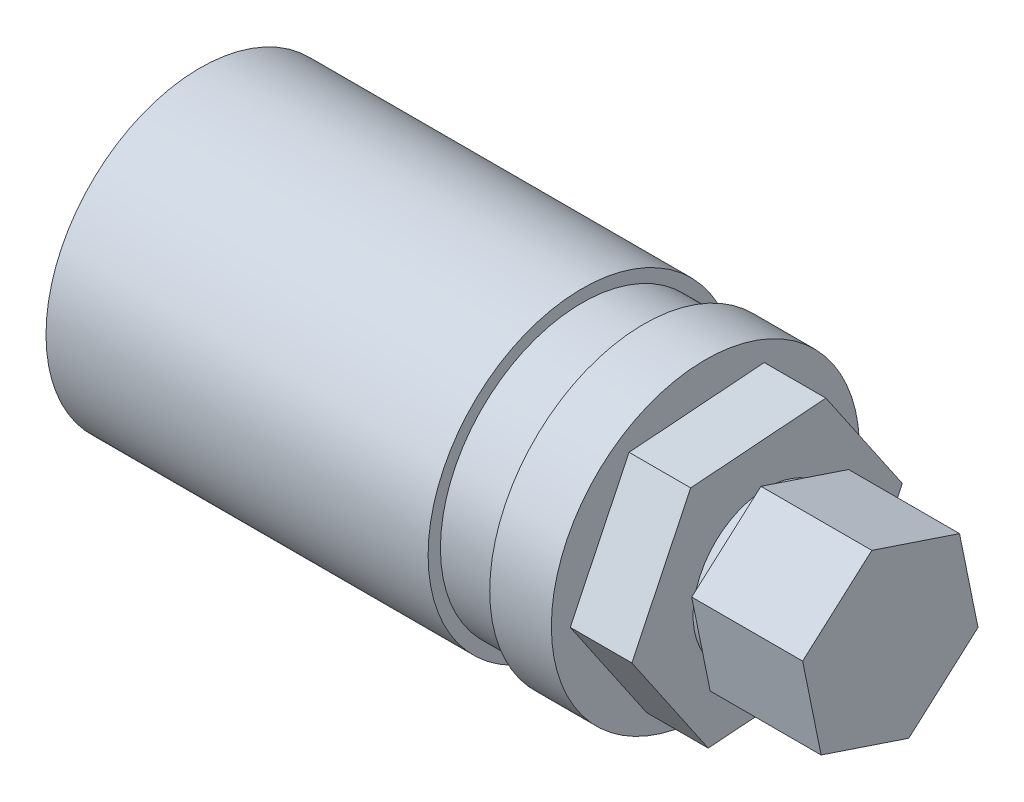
from build123d import *

# Parameters (mm, degrees)
SALIENTE_EXTRUIR1_DEPTH = 5
CROQUIS3_R              = 6
SALIENTE_EXTRUIR2_DEPTH = 1
SALIENTE_EXTRUIR3_DEPTH = 9


with BuildPart() as part:
    # Croquis1 → Revoluci_n1 (revolve)
    with BuildSketch(Plane.XY, mode=Mode.PRIVATE) as revoluci_n1_sk:
        Polygon((0, 0), (0, 12.5), (31, 12.5), (31, 11.5), (36, 11.5), (36, 12.5), (41, 12.5), (41, 0), align=None)
    revolve(revoluci_n1_sk.sketch.rotate(Axis((0, 0, 0), (1, 0, 0)), 90), axis=Axis((0, 0, 0), (1, 0, 0)))

    # Croquis2 → Saliente-Extruir1 (add)
    with BuildSketch(Plane(origin=(41, 0, 0), x_dir=(0, 0, -1), z_dir=(1, 0, 0))):
        Polygon((-6.197083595, 9.088242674), (-10.96919083, -0.822710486), (-4.772107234, -9.91095316), (6.197083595, -9.088242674), (10.96919083, 0.822710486), (4.772107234, 9.91095316), align=None)
    extrude(amount=SALIENTE_EXTRUIR1_DEPTH)

    # Croquis3 → Saliente-Extruir2 (add)
    with BuildSketch(Plane(origin=(46, 0, 0), x_dir=(0, 0, -1), z_dir=(1, 0, 0))):
        Circle(CROQUIS3_R)
    extrude(amount=SALIENTE_EXTRUIR2_DEPTH)

    # Croquis4 → Saliente-Extruir3 (add)
    with BuildSketch(Plane(origin=(47, 0, 0), x_dir=(0, 0, -1), z_dir=(1, 0, 0))):
        Polygon((-1.498151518, 7.348846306), (-7.113363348, 2.37698588), (-5.615211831, -4.971860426), (1.498151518, -7.348846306), (7.113363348, -2.37698588), (5.615211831, 4.971860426), align=None)
    extrude(amount=SALIENTE_EXTRUIR3_DEPTH)


solid = part.part
